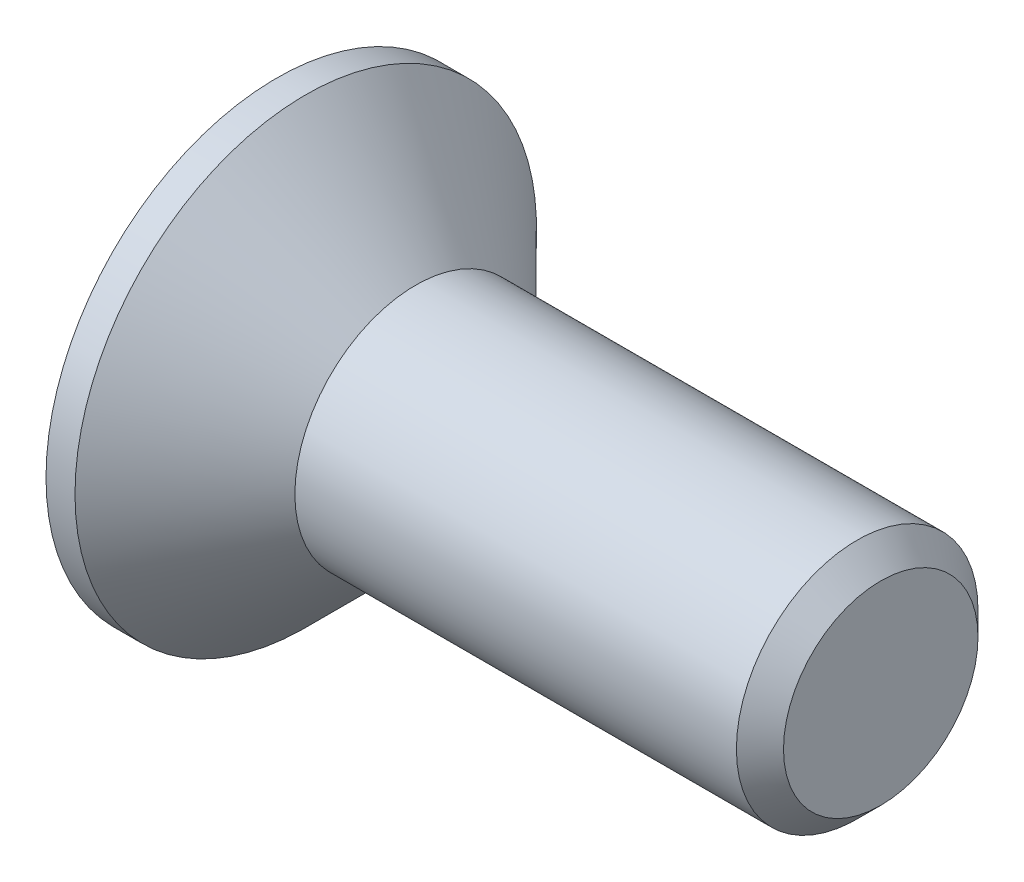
ISO-10303-21;
HEADER;
FILE_DESCRIPTION(('STEP AP214'),'2;1');
FILE_NAME('part.step','',(''),(''),'','','');
FILE_SCHEMA(('AUTOMOTIVE_DESIGN { 1 0 10303 214 1 1 1 1 }'));
ENDSEC;
DATA;
#1=APPLICATION_CONTEXT('core data for automotive mechanical design processes');
#2=APPLICATION_PROTOCOL_DEFINITION('international standard','automotive_design',2000,#1);
#3=PRODUCT_CONTEXT('',#1,'mechanical');
#4=PRODUCT('Part','Part','',(#3));
#5=PRODUCT_RELATED_PRODUCT_CATEGORY('part','',(#4));
#6=PRODUCT_DEFINITION_FORMATION('','',#4);
#7=PRODUCT_DEFINITION_CONTEXT('part definition',#1,'design');
#8=PRODUCT_DEFINITION('design','',#6,#7);
#9=PRODUCT_DEFINITION_SHAPE('','',#8);
#10=(LENGTH_UNIT() NAMED_UNIT(*) SI_UNIT(.MILLI.,.METRE.));
#11=(NAMED_UNIT(*) PLANE_ANGLE_UNIT() SI_UNIT($,.RADIAN.));
#12=(NAMED_UNIT(*) SI_UNIT($,.STERADIAN.) SOLID_ANGLE_UNIT());
#13=UNCERTAINTY_MEASURE_WITH_UNIT(LENGTH_MEASURE(1.E-05),#10,'distance_accuracy_value','');
#14=(GEOMETRIC_REPRESENTATION_CONTEXT(3) GLOBAL_UNCERTAINTY_ASSIGNED_CONTEXT((#13)) GLOBAL_UNIT_ASSIGNED_CONTEXT((#10,
#11,#12)) REPRESENTATION_CONTEXT('',''));
#15=CARTESIAN_POINT('',(0.,0.,0.));
#16=DIRECTION('',(0.,0.,1.));
#17=DIRECTION('',(1.,0.,0.));
#18=AXIS2_PLACEMENT_3D('',#15,#16,#17);
#19=CARTESIAN_POINT('',(0.,0.,0.));
#20=DIRECTION('',(-1.,0.,0.));
#21=DIRECTION('',(0.,0.,1.00000000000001));
#22=AXIS2_PLACEMENT_3D('',#19,#20,#21);
#23=PLANE('',#22);
#24=CARTESIAN_POINT('',(0.,0.,0.));
#25=DIRECTION('',(-1.,0.,0.));
#26=DIRECTION('',(0.,0.,1.00000000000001));
#27=AXIS2_PLACEMENT_3D('',#24,#25,#26);
#28=CIRCLE('',#27,3.82);
#29=CARTESIAN_POINT('',(0.,0.,3.82000000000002));
#30=VERTEX_POINT('',#29);
#31=EDGE_CURVE('E11',#30,#30,#28,.T.);
#32=ORIENTED_EDGE('',*,*,#31,.T.);
#33=EDGE_LOOP('',(#32));
#34=FACE_BOUND('',#33,.T.);
#35=DIRECTION('',(0.,-0.500000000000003,-0.866025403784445));
#36=VECTOR('',#35,1.);
#37=CARTESIAN_POINT('',(0.,-0.727461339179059,1.26000000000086));
#38=LINE('',#37,#36);
#39=CARTESIAN_POINT('',(0.,-0.727461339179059,1.26000000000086));
#40=VERTEX_POINT('',#39);
#41=CARTESIAN_POINT('',(0.,-1.45492267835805,-3.88578058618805E-13));
#42=VERTEX_POINT('',#41);
#43=EDGE_CURVE('E126',#40,#42,#38,.T.);
#44=ORIENTED_EDGE('',*,*,#43,.T.);
#45=DIRECTION('',(0.,0.500000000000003,-0.866025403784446));
#46=VECTOR('',#45,1.);
#47=CARTESIAN_POINT('',(0.,-1.45492267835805,-3.88578058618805E-13));
#48=LINE('',#47,#46);
#49=CARTESIAN_POINT('',(0.,-0.727461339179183,-1.26000000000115));
#50=VERTEX_POINT('',#49);
#51=EDGE_CURVE('E46',#42,#50,#48,.T.);
#52=ORIENTED_EDGE('',*,*,#51,.T.);
#53=DIRECTION('',(0.,1.00000000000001,0.));
#54=VECTOR('',#53,1.);
#55=CARTESIAN_POINT('',(0.,-0.727461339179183,-1.26000000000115));
#56=LINE('',#55,#54);
#57=CARTESIAN_POINT('',(0.,0.727461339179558,-1.25999999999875));
#58=VERTEX_POINT('',#57);
#59=EDGE_CURVE('E117',#50,#58,#56,.T.);
#60=ORIENTED_EDGE('',*,*,#59,.T.);
#61=DIRECTION('',(0.,0.500000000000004,0.866025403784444));
#62=VECTOR('',#61,1.);
#63=CARTESIAN_POINT('',(0.,0.727461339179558,-1.25999999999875));
#64=LINE('',#63,#62);
#65=CARTESIAN_POINT('',(0.,1.45492267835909,-1.94289029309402E-13));
#66=VERTEX_POINT('',#65);
#67=EDGE_CURVE('E120',#58,#66,#64,.T.);
#68=ORIENTED_EDGE('',*,*,#67,.T.);
#69=DIRECTION('',(0.,-0.500000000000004,0.866025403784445));
#70=VECTOR('',#69,1.);
#71=CARTESIAN_POINT('',(0.,1.45492267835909,-1.94289029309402E-13));
#72=LINE('',#71,#70);
#73=CARTESIAN_POINT('',(0.,0.727461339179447,1.26000000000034));
#74=VERTEX_POINT('',#73);
#75=EDGE_CURVE('E123',#66,#74,#72,.T.);
#76=ORIENTED_EDGE('',*,*,#75,.T.);
#77=DIRECTION('',(0.,-1.00000000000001,0.));
#78=VECTOR('',#77,1.);
#79=CARTESIAN_POINT('',(0.,0.727461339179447,1.26000000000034));
#80=LINE('',#79,#78);
#81=EDGE_CURVE('E107',#74,#40,#80,.T.);
#82=ORIENTED_EDGE('',*,*,#81,.T.);
#83=EDGE_LOOP('',(#44,#52,#60,#68,#76,#82));
#84=FACE_BOUND('',#83,.T.);
#85=ADVANCED_FACE('F32',(#34,#84),#23,.T.);
#86=CARTESIAN_POINT('',(0.,0.,0.));
#87=DIRECTION('',(-1.,0.,0.));
#88=DIRECTION('',(0.,0.,1.00000000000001));
#89=AXIS2_PLACEMENT_3D('',#86,#87,#88);
#90=CYLINDRICAL_SURFACE('',#89,3.82);
#91=CARTESIAN_POINT('',(0.480000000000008,0.,0.));
#92=DIRECTION('',(-1.,0.,0.));
#93=DIRECTION('',(0.,0.,1.00000000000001));
#94=AXIS2_PLACEMENT_3D('',#91,#92,#93);
#95=CIRCLE('',#94,3.82);
#96=CARTESIAN_POINT('',(0.480000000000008,0.,3.81999999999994));
#97=VERTEX_POINT('',#96);
#98=EDGE_CURVE('E39',#97,#97,#95,.T.);
#99=ORIENTED_EDGE('',*,*,#98,.T.);
#100=EDGE_LOOP('',(#99));
#101=FACE_BOUND('',#100,.T.);
#102=ORIENTED_EDGE('',*,*,#31,.F.);
#103=EDGE_LOOP('',(#102));
#104=FACE_BOUND('',#103,.T.);
#105=ADVANCED_FACE('F148',(#101,#104),#90,.T.);
#106=CARTESIAN_POINT('',(0.480000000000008,0.,0.));
#107=DIRECTION('',(-1.,0.,0.));
#108=DIRECTION('',(0.,0.,1.00000000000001));
#109=AXIS2_PLACEMENT_3D('',#106,#107,#108);
#110=CONICAL_SURFACE('',#109,3.82,0.78539816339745);
#111=CARTESIAN_POINT('',(2.3,-1.38777878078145E-13,0.));
#112=DIRECTION('',(-1.,0.,0.));
#113=DIRECTION('',(0.,0.,1.00000000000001));
#114=AXIS2_PLACEMENT_3D('',#111,#112,#113);
#115=CIRCLE('',#114,2.);
#116=CARTESIAN_POINT('',(2.3,-1.38777878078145E-13,2.00000000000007));
#117=VERTEX_POINT('',#116);
#118=EDGE_CURVE('E143',#117,#117,#115,.T.);
#119=ORIENTED_EDGE('',*,*,#118,.T.);
#120=EDGE_LOOP('',(#119));
#121=FACE_BOUND('',#120,.T.);
#122=ORIENTED_EDGE('',*,*,#98,.F.);
#123=EDGE_LOOP('',(#122));
#124=FACE_BOUND('',#123,.T.);
#125=ADVANCED_FACE('F151',(#121,#124),#110,.T.);
#126=CARTESIAN_POINT('',(0.,0.,0.));
#127=DIRECTION('',(-1.,0.,0.));
#128=DIRECTION('',(0.,0.,1.00000000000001));
#129=AXIS2_PLACEMENT_3D('',#126,#127,#128);
#130=CYLINDRICAL_SURFACE('',#129,2.);
#131=CARTESIAN_POINT('',(9.61000000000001,0.,1.2490009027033E-13));
#132=DIRECTION('',(-1.,0.,0.));
#133=DIRECTION('',(0.,0.,1.00000000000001));
#134=AXIS2_PLACEMENT_3D('',#131,#132,#133);
#135=CIRCLE('',#134,2.);
#136=CARTESIAN_POINT('',(9.61000000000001,0.,2.00000000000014));
#137=VERTEX_POINT('',#136);
#138=EDGE_CURVE('E140',#137,#137,#135,.T.);
#139=ORIENTED_EDGE('',*,*,#138,.T.);
#140=EDGE_LOOP('',(#139));
#141=FACE_BOUND('',#140,.T.);
#142=ORIENTED_EDGE('',*,*,#118,.F.);
#143=EDGE_LOOP('',(#142));
#144=FACE_BOUND('',#143,.T.);
#145=ADVANCED_FACE('F153',(#141,#144),#130,.T.);
#146=CARTESIAN_POINT('',(10.,-1.2490009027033E-13,0.));
#147=DIRECTION('',(-1.,0.,0.));
#148=DIRECTION('',(0.,0.,1.00000000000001));
#149=AXIS2_PLACEMENT_3D('',#146,#147,#148);
#150=CONICAL_SURFACE('',#149,1.61,0.785398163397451);
#151=ORIENTED_EDGE('',*,*,#138,.F.);
#152=EDGE_LOOP('',(#151));
#153=FACE_BOUND('',#152,.T.);
#154=CARTESIAN_POINT('',(10.,-1.2490009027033E-13,0.));
#155=DIRECTION('',(-1.,0.,0.));
#156=DIRECTION('',(0.,0.,1.00000000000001));
#157=AXIS2_PLACEMENT_3D('',#154,#155,#156);
#158=CIRCLE('',#157,1.61);
#159=CARTESIAN_POINT('',(10.,-1.2490009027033E-13,1.61000000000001));
#160=VERTEX_POINT('',#159);
#161=EDGE_CURVE('E137',#160,#160,#158,.T.);
#162=ORIENTED_EDGE('',*,*,#161,.T.);
#163=EDGE_LOOP('',(#162));
#164=FACE_BOUND('',#163,.T.);
#165=ADVANCED_FACE('F160',(#153,#164),#150,.T.);
#166=CARTESIAN_POINT('',(9.99999999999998,1.61000000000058,0.));
#167=DIRECTION('',(1.,0.,0.));
#168=DIRECTION('',(0.,0.,-1.00000000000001));
#169=AXIS2_PLACEMENT_3D('',#166,#167,#168);
#170=PLANE('',#169);
#171=ORIENTED_EDGE('',*,*,#161,.F.);
#172=EDGE_LOOP('',(#171));
#173=FACE_BOUND('',#172,.T.);
#174=ADVANCED_FACE('F187',(#173),#170,.T.);
#175=CARTESIAN_POINT('',(1.79999999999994,-1.45492267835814,-4.16333634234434E-13));
#176=DIRECTION('',(0.,0.866025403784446,0.500000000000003));
#177=DIRECTION('',(0.,-0.500000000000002,0.866025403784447));
#178=AXIS2_PLACEMENT_3D('',#175,#176,#177);
#179=PLANE('',#178);
#180=ORIENTED_EDGE('',*,*,#51,.F.);
#181=DIRECTION('',(-1.,0.,0.));
#182=VECTOR('',#181,1.);
#183=CARTESIAN_POINT('',(1.79999999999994,-1.45492267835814,-4.16333634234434E-13));
#184=LINE('',#183,#182);
#185=CARTESIAN_POINT('',(1.79999999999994,-1.45492267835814,-4.16333634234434E-13));
#186=VERTEX_POINT('',#185);
#187=EDGE_CURVE('E112',#186,#42,#184,.T.);
#188=ORIENTED_EDGE('',*,*,#187,.F.);
#189=DIRECTION('',(0.,0.500000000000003,-0.866025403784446));
#190=VECTOR('',#189,1.);
#191=CARTESIAN_POINT('',(1.79999999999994,-1.45492267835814,-4.16333634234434E-13));
#192=LINE('',#191,#190);
#193=CARTESIAN_POINT('',(1.80000000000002,-0.727461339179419,-1.26000000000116));
#194=VERTEX_POINT('',#193);
#195=EDGE_CURVE('E129',#186,#194,#192,.T.);
#196=ORIENTED_EDGE('',*,*,#195,.T.);
#197=DIRECTION('',(-1.,0.,0.));
#198=VECTOR('',#197,1.);
#199=CARTESIAN_POINT('',(1.80000000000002,-0.727461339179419,-1.26000000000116));
#200=LINE('',#199,#198);
#201=EDGE_CURVE('E135',#194,#50,#200,.T.);
#202=ORIENTED_EDGE('',*,*,#201,.T.);
#203=EDGE_LOOP('',(#180,#188,#196,#202));
#204=FACE_BOUND('',#203,.T.);
#205=ADVANCED_FACE('F170',(#204),#179,.T.);
#206=CARTESIAN_POINT('',(1.80000000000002,-0.727461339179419,-1.26000000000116));
#207=DIRECTION('',(0.,0.,1.00000000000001));
#208=DIRECTION('',(1.,0.,0.));
#209=AXIS2_PLACEMENT_3D('',#206,#207,#208);
#210=PLANE('',#209);
#211=ORIENTED_EDGE('',*,*,#59,.F.);
#212=ORIENTED_EDGE('',*,*,#201,.F.);
#213=DIRECTION('',(0.,1.00000000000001,0.));
#214=VECTOR('',#213,1.);
#215=CARTESIAN_POINT('',(1.80000000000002,-0.727461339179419,-1.26000000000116));
#216=LINE('',#215,#214);
#217=CARTESIAN_POINT('',(1.80000000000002,0.727461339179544,-1.25999999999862));
#218=VERTEX_POINT('',#217);
#219=EDGE_CURVE('E85',#194,#218,#216,.T.);
#220=ORIENTED_EDGE('',*,*,#219,.T.);
#221=DIRECTION('',(-1.,0.,0.));
#222=VECTOR('',#221,1.);
#223=CARTESIAN_POINT('',(1.80000000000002,0.727461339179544,-1.25999999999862));
#224=LINE('',#223,#222);
#225=EDGE_CURVE('E133',#218,#58,#224,.T.);
#226=ORIENTED_EDGE('',*,*,#225,.T.);
#227=EDGE_LOOP('',(#211,#212,#220,#226));
#228=FACE_BOUND('',#227,.T.);
#229=ADVANCED_FACE('F179',(#228),#210,.T.);
#230=CARTESIAN_POINT('',(1.80000000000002,0.727461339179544,-1.25999999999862));
#231=DIRECTION('',(0.,-0.866025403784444,0.500000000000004));
#232=DIRECTION('',(0.,-0.500000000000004,-0.866025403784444));
#233=AXIS2_PLACEMENT_3D('',#230,#231,#232);
#234=PLANE('',#233);
#235=ORIENTED_EDGE('',*,*,#67,.F.);
#236=ORIENTED_EDGE('',*,*,#225,.F.);
#237=DIRECTION('',(0.,0.500000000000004,0.866025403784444));
#238=VECTOR('',#237,1.);
#239=CARTESIAN_POINT('',(1.80000000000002,0.727461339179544,-1.25999999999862));
#240=LINE('',#239,#238);
#241=CARTESIAN_POINT('',(1.79999999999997,1.45492267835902,-2.77555756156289E-13));
#242=VERTEX_POINT('',#241);
#243=EDGE_CURVE('E103',#218,#242,#240,.T.);
#244=ORIENTED_EDGE('',*,*,#243,.T.);
#245=DIRECTION('',(-1.,0.,0.));
#246=VECTOR('',#245,1.);
#247=CARTESIAN_POINT('',(1.79999999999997,1.45492267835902,-2.77555756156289E-13));
#248=LINE('',#247,#246);
#249=EDGE_CURVE('E100',#242,#66,#248,.T.);
#250=ORIENTED_EDGE('',*,*,#249,.T.);
#251=EDGE_LOOP('',(#235,#236,#244,#250));
#252=FACE_BOUND('',#251,.T.);
#253=ADVANCED_FACE('F177',(#252),#234,.T.);
#254=CARTESIAN_POINT('',(1.79999999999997,1.45492267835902,-2.77555756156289E-13));
#255=DIRECTION('',(0.,-0.866025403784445,-0.500000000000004));
#256=DIRECTION('',(0.,0.500000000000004,-0.866025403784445));
#257=AXIS2_PLACEMENT_3D('',#254,#255,#256);
#258=PLANE('',#257);
#259=ORIENTED_EDGE('',*,*,#75,.F.);
#260=ORIENTED_EDGE('',*,*,#249,.F.);
#261=DIRECTION('',(0.,-0.500000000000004,0.866025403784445));
#262=VECTOR('',#261,1.);
#263=CARTESIAN_POINT('',(1.79999999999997,1.45492267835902,-2.77555756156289E-13));
#264=LINE('',#263,#262);
#265=CARTESIAN_POINT('',(1.8,0.727461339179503,1.26000000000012));
#266=VERTEX_POINT('',#265);
#267=EDGE_CURVE('E95',#242,#266,#264,.T.);
#268=ORIENTED_EDGE('',*,*,#267,.T.);
#269=DIRECTION('',(-1.,0.,0.));
#270=VECTOR('',#269,1.);
#271=CARTESIAN_POINT('',(1.8,0.727461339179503,1.26000000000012));
#272=LINE('',#271,#270);
#273=EDGE_CURVE('E99',#266,#74,#272,.T.);
#274=ORIENTED_EDGE('',*,*,#273,.T.);
#275=EDGE_LOOP('',(#259,#260,#268,#274));
#276=FACE_BOUND('',#275,.T.);
#277=ADVANCED_FACE('F98',(#276),#258,.T.);
#278=CARTESIAN_POINT('',(1.8,0.727461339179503,1.26000000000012));
#279=DIRECTION('',(0.,0.,-1.00000000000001));
#280=DIRECTION('',(-1.,0.,0.));
#281=AXIS2_PLACEMENT_3D('',#278,#279,#280);
#282=PLANE('',#281);
#283=ORIENTED_EDGE('',*,*,#81,.F.);
#284=ORIENTED_EDGE('',*,*,#273,.F.);
#285=DIRECTION('',(0.,-1.00000000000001,0.));
#286=VECTOR('',#285,1.);
#287=CARTESIAN_POINT('',(1.8,0.727461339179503,1.26000000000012));
#288=LINE('',#287,#286);
#289=CARTESIAN_POINT('',(1.80000000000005,-0.727461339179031,1.26000000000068));
#290=VERTEX_POINT('',#289);
#291=EDGE_CURVE('E102',#266,#290,#288,.T.);
#292=ORIENTED_EDGE('',*,*,#291,.T.);
#293=DIRECTION('',(-1.,0.,0.));
#294=VECTOR('',#293,1.);
#295=CARTESIAN_POINT('',(1.80000000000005,-0.727461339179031,1.26000000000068));
#296=LINE('',#295,#294);
#297=EDGE_CURVE('E76',#290,#40,#296,.T.);
#298=ORIENTED_EDGE('',*,*,#297,.T.);
#299=EDGE_LOOP('',(#283,#284,#292,#298));
#300=FACE_BOUND('',#299,.T.);
#301=ADVANCED_FACE('F105',(#300),#282,.T.);
#302=CARTESIAN_POINT('',(1.80000000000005,-0.727461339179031,1.26000000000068));
#303=DIRECTION('',(0.,0.866025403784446,-0.500000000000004));
#304=DIRECTION('',(0.,0.500000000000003,0.866025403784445));
#305=AXIS2_PLACEMENT_3D('',#302,#303,#304);
#306=PLANE('',#305);
#307=ORIENTED_EDGE('',*,*,#43,.F.);
#308=ORIENTED_EDGE('',*,*,#297,.F.);
#309=DIRECTION('',(0.,-0.500000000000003,-0.866025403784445));
#310=VECTOR('',#309,1.);
#311=CARTESIAN_POINT('',(1.80000000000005,-0.727461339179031,1.26000000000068));
#312=LINE('',#311,#310);
#313=EDGE_CURVE('E54',#290,#186,#312,.T.);
#314=ORIENTED_EDGE('',*,*,#313,.T.);
#315=ORIENTED_EDGE('',*,*,#187,.T.);
#316=EDGE_LOOP('',(#307,#308,#314,#315));
#317=FACE_BOUND('',#316,.T.);
#318=ADVANCED_FACE('F169',(#317),#306,.T.);
#319=CARTESIAN_POINT('',(1.80000000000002,-0.727461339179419,-1.26000000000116));
#320=DIRECTION('',(1.,0.,0.));
#321=DIRECTION('',(0.,0.,-1.00000000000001));
#322=AXIS2_PLACEMENT_3D('',#319,#320,#321);
#323=PLANE('',#322);
#324=ORIENTED_EDGE('',*,*,#195,.F.);
#325=ORIENTED_EDGE('',*,*,#313,.F.);
#326=ORIENTED_EDGE('',*,*,#291,.F.);
#327=ORIENTED_EDGE('',*,*,#267,.F.);
#328=ORIENTED_EDGE('',*,*,#243,.F.);
#329=ORIENTED_EDGE('',*,*,#219,.F.);
#330=EDGE_LOOP('',(#324,#325,#326,#327,#328,#329));
#331=FACE_BOUND('',#330,.T.);
#332=ADVANCED_FACE('F110',(#331),#323,.F.);
#333=CLOSED_SHELL('',(#85,#105,#125,#145,#165,#174,#205,#229,#253,#277,#301,#318,#332));
#334=MANIFOLD_SOLID_BREP('B2',#333);
#335=ADVANCED_BREP_SHAPE_REPRESENTATION('',(#18,#334),#14);
#336=SHAPE_DEFINITION_REPRESENTATION(#9,#335);
ENDSEC;
END-ISO-10303-21;
